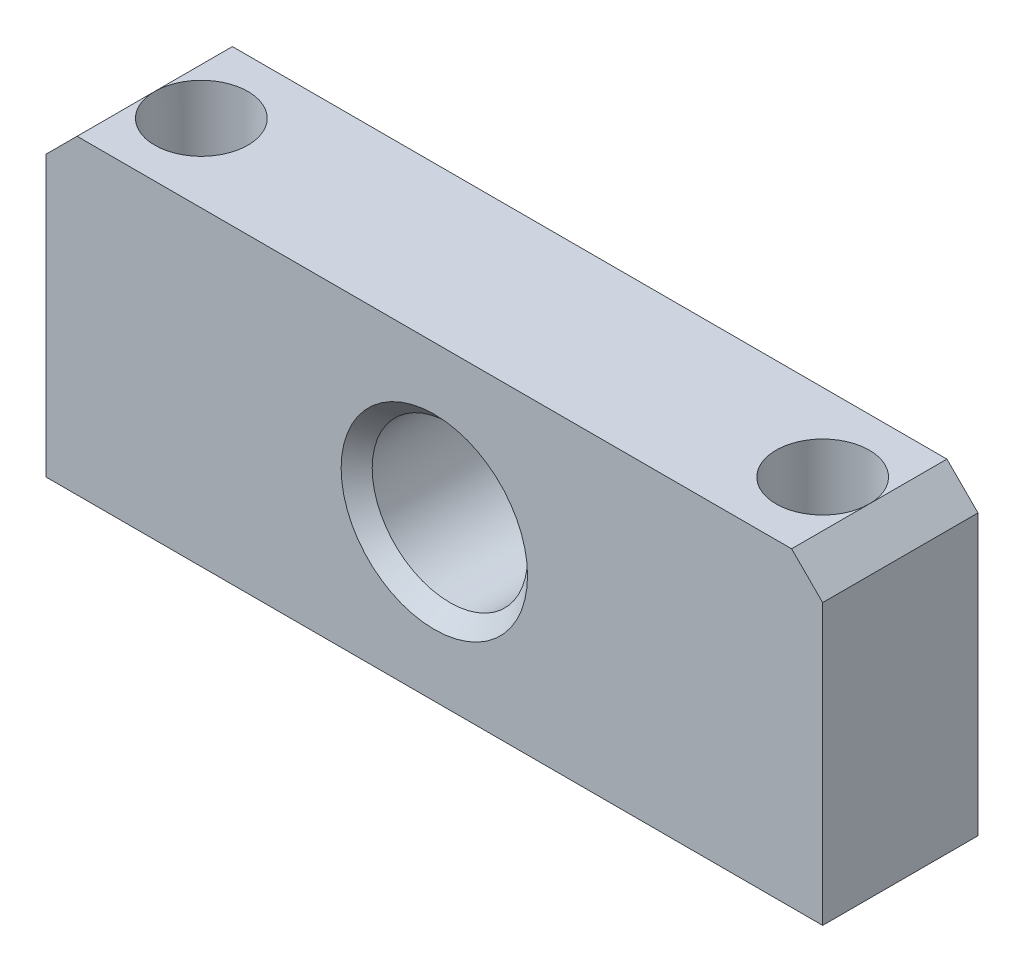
ISO-10303-21;
HEADER;
FILE_DESCRIPTION(('STEP AP214'),'2;1');
FILE_NAME('part.step','',(''),(''),'','','');
FILE_SCHEMA(('AUTOMOTIVE_DESIGN { 1 0 10303 214 1 1 1 1 }'));
ENDSEC;
DATA;
#1=APPLICATION_CONTEXT('core data for automotive mechanical design processes');
#2=APPLICATION_PROTOCOL_DEFINITION('international standard','automotive_design',2000,#1);
#3=PRODUCT_CONTEXT('',#1,'mechanical');
#4=PRODUCT('Part','Part','',(#3));
#5=PRODUCT_RELATED_PRODUCT_CATEGORY('part','',(#4));
#6=PRODUCT_DEFINITION_FORMATION('','',#4);
#7=PRODUCT_DEFINITION_CONTEXT('part definition',#1,'design');
#8=PRODUCT_DEFINITION('design','',#6,#7);
#9=PRODUCT_DEFINITION_SHAPE('','',#8);
#10=(LENGTH_UNIT() NAMED_UNIT(*) SI_UNIT(.MILLI.,.METRE.));
#11=(NAMED_UNIT(*) PLANE_ANGLE_UNIT() SI_UNIT($,.RADIAN.));
#12=(NAMED_UNIT(*) SI_UNIT($,.STERADIAN.) SOLID_ANGLE_UNIT());
#13=UNCERTAINTY_MEASURE_WITH_UNIT(LENGTH_MEASURE(1.E-05),#10,'distance_accuracy_value','');
#14=(GEOMETRIC_REPRESENTATION_CONTEXT(3) GLOBAL_UNCERTAINTY_ASSIGNED_CONTEXT((#13)) GLOBAL_UNIT_ASSIGNED_CONTEXT((#10,
#11,#12)) REPRESENTATION_CONTEXT('',''));
#15=CARTESIAN_POINT('',(0.,0.,0.));
#16=DIRECTION('',(0.,0.,1.));
#17=DIRECTION('',(1.,0.,0.));
#18=AXIS2_PLACEMENT_3D('',#15,#16,#17);
#19=CARTESIAN_POINT('',(0.,0.,10.));
#20=DIRECTION('',(1.,0.,0.));
#21=DIRECTION('',(0.,0.,-1.));
#22=AXIS2_PLACEMENT_3D('',#19,#20,#21);
#23=PLANE('',#22);
#24=DIRECTION('',(0.,-1.,0.));
#25=VECTOR('',#24,1.);
#26=CARTESIAN_POINT('',(0.,0.,10.));
#27=LINE('',#26,#25);
#28=CARTESIAN_POINT('',(0.,18.,10.));
#29=VERTEX_POINT('',#28);
#30=CARTESIAN_POINT('',(0.,0.,10.));
#31=VERTEX_POINT('',#30);
#32=EDGE_CURVE('E214',#29,#31,#27,.T.);
#33=ORIENTED_EDGE('',*,*,#32,.F.);
#34=DIRECTION('',(0.,0.,-1.));
#35=VECTOR('',#34,1.);
#36=CARTESIAN_POINT('',(0.,18.,10.));
#37=LINE('',#36,#35);
#38=CARTESIAN_POINT('',(0.,18.,0.));
#39=VERTEX_POINT('',#38);
#40=EDGE_CURVE('E91',#29,#39,#37,.T.);
#41=ORIENTED_EDGE('',*,*,#40,.T.);
#42=DIRECTION('',(0.,-1.,0.));
#43=VECTOR('',#42,1.);
#44=CARTESIAN_POINT('',(0.,0.,0.));
#45=LINE('',#44,#43);
#46=CARTESIAN_POINT('',(0.,0.,0.));
#47=VERTEX_POINT('',#46);
#48=EDGE_CURVE('E86',#39,#47,#45,.T.);
#49=ORIENTED_EDGE('',*,*,#48,.T.);
#50=DIRECTION('',(0.,0.,-1.));
#51=VECTOR('',#50,1.);
#52=CARTESIAN_POINT('',(0.,0.,10.));
#53=LINE('',#52,#51);
#54=EDGE_CURVE('E89',#31,#47,#53,.T.);
#55=ORIENTED_EDGE('',*,*,#54,.F.);
#56=EDGE_LOOP('',(#33,#41,#49,#55));
#57=FACE_BOUND('',#56,.T.);
#58=ADVANCED_FACE('F24',(#57),#23,.F.);
#59=CARTESIAN_POINT('',(0.,0.,10.));
#60=DIRECTION('',(0.,1.,0.));
#61=DIRECTION('',(0.,0.,1.));
#62=AXIS2_PLACEMENT_3D('',#59,#60,#61);
#63=PLANE('',#62);
#64=CARTESIAN_POINT('',(5.,0.,5.));
#65=DIRECTION('',(0.,1.,0.));
#66=DIRECTION('',(0.,0.,1.));
#67=AXIS2_PLACEMENT_3D('',#64,#65,#66);
#68=CIRCLE('',#67,1.5);
#69=CARTESIAN_POINT('',(5.,0.,6.5));
#70=VERTEX_POINT('',#69);
#71=EDGE_CURVE('E235',#70,#70,#68,.T.);
#72=ORIENTED_EDGE('',*,*,#71,.T.);
#73=EDGE_LOOP('',(#72));
#74=FACE_BOUND('',#73,.T.);
#75=CARTESIAN_POINT('',(45.,0.,5.));
#76=DIRECTION('',(0.,1.,0.));
#77=DIRECTION('',(0.,0.,1.));
#78=AXIS2_PLACEMENT_3D('',#75,#76,#77);
#79=CIRCLE('',#78,1.5);
#80=CARTESIAN_POINT('',(45.,0.,6.50000000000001));
#81=VERTEX_POINT('',#80);
#82=EDGE_CURVE('E229',#81,#81,#79,.T.);
#83=ORIENTED_EDGE('',*,*,#82,.T.);
#84=EDGE_LOOP('',(#83));
#85=FACE_BOUND('',#84,.T.);
#86=DIRECTION('',(1.,0.,0.));
#87=VECTOR('',#86,1.);
#88=CARTESIAN_POINT('',(0.,0.,0.));
#89=LINE('',#88,#87);
#90=CARTESIAN_POINT('',(50.,0.,0.));
#91=VERTEX_POINT('',#90);
#92=EDGE_CURVE('E93',#47,#91,#89,.T.);
#93=ORIENTED_EDGE('',*,*,#92,.T.);
#94=DIRECTION('',(0.,0.,-1.));
#95=VECTOR('',#94,1.);
#96=CARTESIAN_POINT('',(50.,0.,10.));
#97=LINE('',#96,#95);
#98=CARTESIAN_POINT('',(50.,0.,10.));
#99=VERTEX_POINT('',#98);
#100=EDGE_CURVE('E108',#99,#91,#97,.T.);
#101=ORIENTED_EDGE('',*,*,#100,.F.);
#102=DIRECTION('',(1.,0.,0.));
#103=VECTOR('',#102,1.);
#104=CARTESIAN_POINT('',(0.,0.,10.));
#105=LINE('',#104,#103);
#106=EDGE_CURVE('E106',#31,#99,#105,.T.);
#107=ORIENTED_EDGE('',*,*,#106,.F.);
#108=ORIENTED_EDGE('',*,*,#54,.T.);
#109=EDGE_LOOP('',(#93,#101,#107,#108));
#110=FACE_BOUND('',#109,.T.);
#111=ADVANCED_FACE('F105',(#74,#85,#110),#63,.F.);
#112=CARTESIAN_POINT('',(50.,0.,10.));
#113=DIRECTION('',(-1.,0.,0.));
#114=DIRECTION('',(0.,0.,1.));
#115=AXIS2_PLACEMENT_3D('',#112,#113,#114);
#116=PLANE('',#115);
#117=DIRECTION('',(0.,1.,0.));
#118=VECTOR('',#117,1.);
#119=CARTESIAN_POINT('',(50.,0.,0.));
#120=LINE('',#119,#118);
#121=CARTESIAN_POINT('',(50.,18.,0.));
#122=VERTEX_POINT('',#121);
#123=EDGE_CURVE('E99',#91,#122,#120,.T.);
#124=ORIENTED_EDGE('',*,*,#123,.T.);
#125=DIRECTION('',(0.,0.,1.));
#126=VECTOR('',#125,1.);
#127=CARTESIAN_POINT('',(50.,18.,10.));
#128=LINE('',#127,#126);
#129=CARTESIAN_POINT('',(50.,18.,10.));
#130=VERTEX_POINT('',#129);
#131=EDGE_CURVE('E46',#122,#130,#128,.T.);
#132=ORIENTED_EDGE('',*,*,#131,.T.);
#133=DIRECTION('',(0.,1.,0.));
#134=VECTOR('',#133,1.);
#135=CARTESIAN_POINT('',(50.,0.,10.));
#136=LINE('',#135,#134);
#137=EDGE_CURVE('E210',#99,#130,#136,.T.);
#138=ORIENTED_EDGE('',*,*,#137,.F.);
#139=ORIENTED_EDGE('',*,*,#100,.T.);
#140=EDGE_LOOP('',(#124,#132,#138,#139));
#141=FACE_BOUND('',#140,.T.);
#142=ADVANCED_FACE('F150',(#141),#116,.F.);
#143=CARTESIAN_POINT('',(0.,20.,10.));
#144=DIRECTION('',(0.,-1.,0.));
#145=DIRECTION('',(0.,0.,-1.));
#146=AXIS2_PLACEMENT_3D('',#143,#144,#145);
#147=PLANE('',#146);
#148=DIRECTION('',(-1.,0.,0.));
#149=VECTOR('',#148,1.);
#150=CARTESIAN_POINT('',(0.,20.,10.));
#151=LINE('',#150,#149);
#152=CARTESIAN_POINT('',(48.,20.,10.));
#153=VERTEX_POINT('',#152);
#154=CARTESIAN_POINT('',(2.00000000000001,20.,10.));
#155=VERTEX_POINT('',#154);
#156=EDGE_CURVE('E112',#153,#155,#151,.T.);
#157=ORIENTED_EDGE('',*,*,#156,.F.);
#158=DIRECTION('',(0.,0.,-1.));
#159=VECTOR('',#158,1.);
#160=CARTESIAN_POINT('',(48.,20.,10.));
#161=LINE('',#160,#159);
#162=CARTESIAN_POINT('',(48.,20.,5.));
#163=VERTEX_POINT('',#162);
#164=EDGE_CURVE('E119',#153,#163,#161,.T.);
#165=ORIENTED_EDGE('',*,*,#164,.T.);
#166=CARTESIAN_POINT('',(45.,20.,5.));
#167=DIRECTION('',(0.,1.,0.));
#168=DIRECTION('',(0.,0.,1.));
#169=AXIS2_PLACEMENT_3D('',#166,#167,#168);
#170=CIRCLE('',#169,3.);
#171=EDGE_CURVE('E222',#163,#163,#170,.T.);
#172=ORIENTED_EDGE('',*,*,#171,.F.);
#173=DIRECTION('',(0.,0.,-1.));
#174=VECTOR('',#173,1.);
#175=CARTESIAN_POINT('',(48.,20.,10.));
#176=LINE('',#175,#174);
#177=CARTESIAN_POINT('',(48.,20.,0.));
#178=VERTEX_POINT('',#177);
#179=EDGE_CURVE('E117',#163,#178,#176,.T.);
#180=ORIENTED_EDGE('',*,*,#179,.T.);
#181=DIRECTION('',(-1.,0.,0.));
#182=VECTOR('',#181,1.);
#183=CARTESIAN_POINT('',(0.,20.,0.));
#184=LINE('',#183,#182);
#185=CARTESIAN_POINT('',(2.00000000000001,20.,0.));
#186=VERTEX_POINT('',#185);
#187=EDGE_CURVE('E216',#178,#186,#184,.T.);
#188=ORIENTED_EDGE('',*,*,#187,.T.);
#189=DIRECTION('',(0.,0.,1.));
#190=VECTOR('',#189,1.);
#191=CARTESIAN_POINT('',(2.00000000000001,20.,10.));
#192=LINE('',#191,#190);
#193=CARTESIAN_POINT('',(2.00000000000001,20.,5.));
#194=VERTEX_POINT('',#193);
#195=EDGE_CURVE('E110',#186,#194,#192,.T.);
#196=ORIENTED_EDGE('',*,*,#195,.T.);
#197=CARTESIAN_POINT('',(5.,20.,5.));
#198=DIRECTION('',(0.,1.,0.));
#199=DIRECTION('',(0.,0.,1.));
#200=AXIS2_PLACEMENT_3D('',#197,#198,#199);
#201=CIRCLE('',#200,3.);
#202=EDGE_CURVE('E208',#194,#194,#201,.T.);
#203=ORIENTED_EDGE('',*,*,#202,.F.);
#204=DIRECTION('',(0.,0.,1.));
#205=VECTOR('',#204,1.);
#206=CARTESIAN_POINT('',(2.00000000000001,20.,10.));
#207=LINE('',#206,#205);
#208=EDGE_CURVE('E107',#194,#155,#207,.T.);
#209=ORIENTED_EDGE('',*,*,#208,.T.);
#210=EDGE_LOOP('',(#157,#165,#172,#180,#188,#196,#203,#209));
#211=FACE_BOUND('',#210,.T.);
#212=ADVANCED_FACE('F155',(#211),#147,.F.);
#213=CARTESIAN_POINT('',(0.,20.,10.));
#214=DIRECTION('',(0.,0.,-1.));
#215=DIRECTION('',(-1.,0.,0.));
#216=AXIS2_PLACEMENT_3D('',#213,#214,#215);
#217=PLANE('',#216);
#218=CARTESIAN_POINT('',(25.,10.,10.));
#219=DIRECTION('',(0.,0.,-1.));
#220=DIRECTION('',(-1.,0.,0.));
#221=AXIS2_PLACEMENT_3D('',#218,#219,#220);
#222=CIRCLE('',#221,6.00000000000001);
#223=CARTESIAN_POINT('',(19.,10.,10.));
#224=VERTEX_POINT('',#223);
#225=EDGE_CURVE('E11',#224,#224,#222,.T.);
#226=ORIENTED_EDGE('',*,*,#225,.T.);
#227=EDGE_LOOP('',(#226));
#228=FACE_BOUND('',#227,.T.);
#229=ORIENTED_EDGE('',*,*,#137,.T.);
#230=DIRECTION('',(0.707106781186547,-0.707106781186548,0.));
#231=VECTOR('',#230,1.);
#232=CARTESIAN_POINT('',(48.,20.,10.));
#233=LINE('',#232,#231);
#234=EDGE_CURVE('E128',#130,#153,#233,.F.);
#235=ORIENTED_EDGE('',*,*,#234,.T.);
#236=ORIENTED_EDGE('',*,*,#156,.T.);
#237=DIRECTION('',(0.707106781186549,0.707106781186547,0.));
#238=VECTOR('',#237,1.);
#239=CARTESIAN_POINT('',(0.,18.,10.));
#240=LINE('',#239,#238);
#241=EDGE_CURVE('E38',#155,#29,#240,.F.);
#242=ORIENTED_EDGE('',*,*,#241,.T.);
#243=ORIENTED_EDGE('',*,*,#32,.T.);
#244=ORIENTED_EDGE('',*,*,#106,.T.);
#245=EDGE_LOOP('',(#229,#235,#236,#242,#243,#244));
#246=FACE_BOUND('',#245,.T.);
#247=ADVANCED_FACE('F162',(#228,#246),#217,.F.);
#248=CARTESIAN_POINT('',(0.,20.,0.));
#249=DIRECTION('',(0.,0.,-1.));
#250=DIRECTION('',(-1.,0.,0.));
#251=AXIS2_PLACEMENT_3D('',#248,#249,#250);
#252=PLANE('',#251);
#253=CARTESIAN_POINT('',(25.,10.,0.));
#254=DIRECTION('',(0.,0.,1.));
#255=DIRECTION('',(1.,0.,0.));
#256=AXIS2_PLACEMENT_3D('',#253,#254,#255);
#257=CIRCLE('',#256,5.);
#258=CARTESIAN_POINT('',(30.,10.,0.));
#259=VERTEX_POINT('',#258);
#260=EDGE_CURVE('E240',#259,#259,#257,.T.);
#261=ORIENTED_EDGE('',*,*,#260,.T.);
#262=EDGE_LOOP('',(#261));
#263=FACE_BOUND('',#262,.T.);
#264=ORIENTED_EDGE('',*,*,#187,.F.);
#265=DIRECTION('',(-0.707106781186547,0.707106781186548,0.));
#266=VECTOR('',#265,1.);
#267=CARTESIAN_POINT('',(24.,44.,0.));
#268=LINE('',#267,#266);
#269=EDGE_CURVE('E124',#178,#122,#268,.F.);
#270=ORIENTED_EDGE('',*,*,#269,.T.);
#271=ORIENTED_EDGE('',*,*,#123,.F.);
#272=ORIENTED_EDGE('',*,*,#92,.F.);
#273=ORIENTED_EDGE('',*,*,#48,.F.);
#274=DIRECTION('',(-0.707106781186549,-0.707106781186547,0.));
#275=VECTOR('',#274,1.);
#276=CARTESIAN_POINT('',(1.,19.,0.));
#277=LINE('',#276,#275);
#278=EDGE_CURVE('E122',#39,#186,#277,.F.);
#279=ORIENTED_EDGE('',*,*,#278,.T.);
#280=EDGE_LOOP('',(#264,#270,#271,#272,#273,#279));
#281=FACE_BOUND('',#280,.T.);
#282=ADVANCED_FACE('F98',(#263,#281),#252,.T.);
#283=CARTESIAN_POINT('',(45.,10.,5.));
#284=DIRECTION('',(0.,1.,0.));
#285=DIRECTION('',(0.,0.,1.));
#286=AXIS2_PLACEMENT_3D('',#283,#284,#285);
#287=CYLINDRICAL_SURFACE('',#286,3.);
#288=CARTESIAN_POINT('',(45.,10.,5.));
#289=DIRECTION('',(0.,1.,0.));
#290=DIRECTION('',(0.,0.,1.));
#291=AXIS2_PLACEMENT_3D('',#288,#289,#290);
#292=CIRCLE('',#291,3.);
#293=CARTESIAN_POINT('',(45.,10.,8.));
#294=VERTEX_POINT('',#293);
#295=EDGE_CURVE('E94',#294,#294,#292,.T.);
#296=ORIENTED_EDGE('',*,*,#295,.F.);
#297=EDGE_LOOP('',(#296));
#298=FACE_BOUND('',#297,.T.);
#299=ORIENTED_EDGE('',*,*,#171,.T.);
#300=EDGE_LOOP('',(#299));
#301=FACE_BOUND('',#300,.T.);
#302=ADVANCED_FACE('F169',(#298,#301),#287,.F.);
#303=CARTESIAN_POINT('',(45.,10.,5.));
#304=DIRECTION('',(0.,1.,0.));
#305=DIRECTION('',(0.,0.,1.));
#306=AXIS2_PLACEMENT_3D('',#303,#304,#305);
#307=PLANE('',#306);
#308=CARTESIAN_POINT('',(45.,10.,5.));
#309=DIRECTION('',(0.,1.,0.));
#310=DIRECTION('',(0.,0.,1.));
#311=AXIS2_PLACEMENT_3D('',#308,#309,#310);
#312=CIRCLE('',#311,1.5);
#313=CARTESIAN_POINT('',(45.,10.,6.50000000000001));
#314=VERTEX_POINT('',#313);
#315=EDGE_CURVE('E232',#314,#314,#312,.T.);
#316=ORIENTED_EDGE('',*,*,#315,.F.);
#317=EDGE_LOOP('',(#316));
#318=FACE_BOUND('',#317,.T.);
#319=ORIENTED_EDGE('',*,*,#295,.T.);
#320=EDGE_LOOP('',(#319));
#321=FACE_BOUND('',#320,.T.);
#322=ADVANCED_FACE('F173',(#318,#321),#307,.T.);
#323=CARTESIAN_POINT('',(5.,10.,5.));
#324=DIRECTION('',(0.,1.,0.));
#325=DIRECTION('',(0.,0.,1.));
#326=AXIS2_PLACEMENT_3D('',#323,#324,#325);
#327=CYLINDRICAL_SURFACE('',#326,3.);
#328=CARTESIAN_POINT('',(5.,10.,5.));
#329=DIRECTION('',(0.,1.,0.));
#330=DIRECTION('',(0.,0.,1.));
#331=AXIS2_PLACEMENT_3D('',#328,#329,#330);
#332=CIRCLE('',#331,3.);
#333=CARTESIAN_POINT('',(5.,10.,8.));
#334=VERTEX_POINT('',#333);
#335=EDGE_CURVE('E225',#334,#334,#332,.T.);
#336=ORIENTED_EDGE('',*,*,#335,.F.);
#337=EDGE_LOOP('',(#336));
#338=FACE_BOUND('',#337,.T.);
#339=ORIENTED_EDGE('',*,*,#202,.T.);
#340=EDGE_LOOP('',(#339));
#341=FACE_BOUND('',#340,.T.);
#342=ADVANCED_FACE('F177',(#338,#341),#327,.F.);
#343=CARTESIAN_POINT('',(5.,10.,5.));
#344=DIRECTION('',(0.,1.,0.));
#345=DIRECTION('',(0.,0.,1.));
#346=AXIS2_PLACEMENT_3D('',#343,#344,#345);
#347=PLANE('',#346);
#348=CARTESIAN_POINT('',(5.,10.,5.));
#349=DIRECTION('',(0.,1.,0.));
#350=DIRECTION('',(0.,0.,1.));
#351=AXIS2_PLACEMENT_3D('',#348,#349,#350);
#352=CIRCLE('',#351,1.5);
#353=CARTESIAN_POINT('',(5.,10.,6.5));
#354=VERTEX_POINT('',#353);
#355=EDGE_CURVE('E237',#354,#354,#352,.T.);
#356=ORIENTED_EDGE('',*,*,#355,.F.);
#357=EDGE_LOOP('',(#356));
#358=FACE_BOUND('',#357,.T.);
#359=ORIENTED_EDGE('',*,*,#335,.T.);
#360=EDGE_LOOP('',(#359));
#361=FACE_BOUND('',#360,.T.);
#362=ADVANCED_FACE('F181',(#358,#361),#347,.T.);
#363=CARTESIAN_POINT('',(45.,0.,5.));
#364=DIRECTION('',(0.,1.,0.));
#365=DIRECTION('',(0.,0.,1.));
#366=AXIS2_PLACEMENT_3D('',#363,#364,#365);
#367=CYLINDRICAL_SURFACE('',#366,1.5);
#368=ORIENTED_EDGE('',*,*,#82,.F.);
#369=EDGE_LOOP('',(#368));
#370=FACE_BOUND('',#369,.T.);
#371=ORIENTED_EDGE('',*,*,#315,.T.);
#372=EDGE_LOOP('',(#371));
#373=FACE_BOUND('',#372,.T.);
#374=ADVANCED_FACE('F185',(#370,#373),#367,.F.);
#375=CARTESIAN_POINT('',(5.,0.,5.));
#376=DIRECTION('',(0.,1.,0.));
#377=DIRECTION('',(0.,0.,1.));
#378=AXIS2_PLACEMENT_3D('',#375,#376,#377);
#379=CYLINDRICAL_SURFACE('',#378,1.5);
#380=ORIENTED_EDGE('',*,*,#71,.F.);
#381=EDGE_LOOP('',(#380));
#382=FACE_BOUND('',#381,.T.);
#383=ORIENTED_EDGE('',*,*,#355,.T.);
#384=EDGE_LOOP('',(#383));
#385=FACE_BOUND('',#384,.T.);
#386=ADVANCED_FACE('F189',(#382,#385),#379,.F.);
#387=CARTESIAN_POINT('',(48.,20.,10.));
#388=DIRECTION('',(-0.707106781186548,-0.707106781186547,0.));
#389=DIRECTION('',(0.707106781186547,-0.707106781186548,0.));
#390=AXIS2_PLACEMENT_3D('',#387,#388,#389);
#391=PLANE('',#390);
#392=ORIENTED_EDGE('',*,*,#234,.F.);
#393=ORIENTED_EDGE('',*,*,#131,.F.);
#394=ORIENTED_EDGE('',*,*,#269,.F.);
#395=ORIENTED_EDGE('',*,*,#179,.F.);
#396=ORIENTED_EDGE('',*,*,#164,.F.);
#397=EDGE_LOOP('',(#392,#393,#394,#395,#396));
#398=FACE_BOUND('',#397,.T.);
#399=ADVANCED_FACE('F193',(#398),#391,.F.);
#400=CARTESIAN_POINT('',(0.,18.,10.));
#401=DIRECTION('',(0.707106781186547,-0.707106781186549,0.));
#402=DIRECTION('',(0.707106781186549,0.707106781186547,0.));
#403=AXIS2_PLACEMENT_3D('',#400,#401,#402);
#404=PLANE('',#403);
#405=ORIENTED_EDGE('',*,*,#208,.F.);
#406=ORIENTED_EDGE('',*,*,#195,.F.);
#407=ORIENTED_EDGE('',*,*,#278,.F.);
#408=ORIENTED_EDGE('',*,*,#40,.F.);
#409=ORIENTED_EDGE('',*,*,#241,.F.);
#410=EDGE_LOOP('',(#405,#406,#407,#408,#409));
#411=FACE_BOUND('',#410,.T.);
#412=ADVANCED_FACE('F143',(#411),#404,.F.);
#413=CARTESIAN_POINT('',(25.,10.,0.));
#414=DIRECTION('',(0.,0.,1.));
#415=DIRECTION('',(1.,0.,0.));
#416=AXIS2_PLACEMENT_3D('',#413,#414,#415);
#417=CYLINDRICAL_SURFACE('',#416,5.);
#418=CARTESIAN_POINT('',(25.,10.,9.));
#419=DIRECTION('',(0.,0.,-1.));
#420=DIRECTION('',(-1.,0.,0.));
#421=AXIS2_PLACEMENT_3D('',#418,#419,#420);
#422=CIRCLE('',#421,5.);
#423=CARTESIAN_POINT('',(20.,10.,9.));
#424=VERTEX_POINT('',#423);
#425=EDGE_CURVE('E31',#424,#424,#422,.F.);
#426=ORIENTED_EDGE('',*,*,#425,.T.);
#427=EDGE_LOOP('',(#426));
#428=FACE_BOUND('',#427,.T.);
#429=ORIENTED_EDGE('',*,*,#260,.F.);
#430=EDGE_LOOP('',(#429));
#431=FACE_BOUND('',#430,.T.);
#432=ADVANCED_FACE('F133',(#428,#431),#417,.F.);
#433=CARTESIAN_POINT('',(25.,10.,9.));
#434=DIRECTION('',(0.,0.,1.));
#435=DIRECTION('',(1.,0.,0.));
#436=AXIS2_PLACEMENT_3D('',#433,#434,#435);
#437=CONICAL_SURFACE('',#436,5.,0.78539816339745);
#438=ORIENTED_EDGE('',*,*,#225,.F.);
#439=EDGE_LOOP('',(#438));
#440=FACE_BOUND('',#439,.T.);
#441=ORIENTED_EDGE('',*,*,#425,.F.);
#442=EDGE_LOOP('',(#441));
#443=FACE_BOUND('',#442,.T.);
#444=ADVANCED_FACE('F136',(#440,#443),#437,.F.);
#445=CLOSED_SHELL('',(#58,#111,#142,#212,#247,#282,#302,#322,#342,#362,#374,#386,#399,#412,#432,#444));
#446=MANIFOLD_SOLID_BREP('B2',#445);
#447=ADVANCED_BREP_SHAPE_REPRESENTATION('',(#18,#446),#14);
#448=SHAPE_DEFINITION_REPRESENTATION(#9,#447);
ENDSEC;
END-ISO-10303-21;
